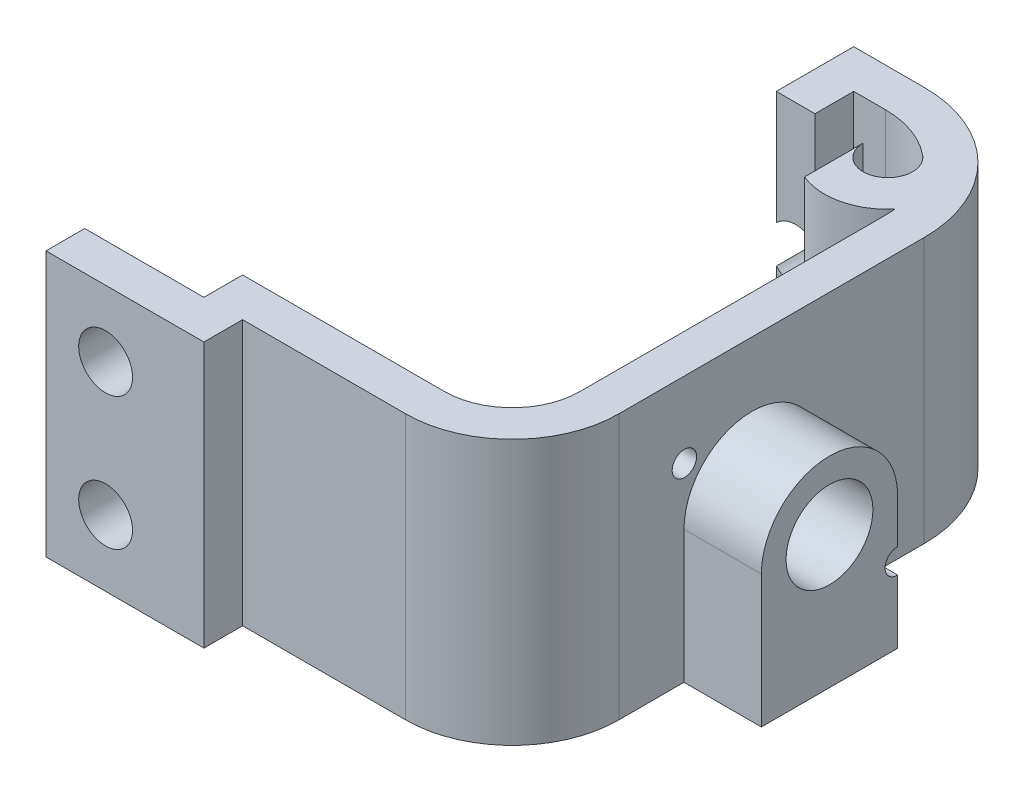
from build123d import *

# Parameters (mm, degrees)
BOSS_EXTRUDE1_DEPTH = 21.75
CUT_EXTRUDE1_REACH  = 62.665
SKETCH2_R           = 0.999998
BOSS_EXTRUDE2_START = 6.35
SKETCH4_R           = 3.5625
BOSS_EXTRUDE2_DEPTH = 6.35
CUT_EXTRUDE2_REACH  = 62.665
SKETCH4_3_R         = 3.5625
SKETCH7_R           = 2.2098
CUT_EXTRUDE3_DEPTH  = 61.338615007
SKETCH9_R           = 2.2098
CUT_EXTRUDE5_DEPTH  = 63.553979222
BOSS_EXTRUDE4_DEPTH = 21.75


with BuildPart() as part:
    # Sketch1 → Boss-Extrude1 (new body)
    with BuildSketch(Plane(origin=(0, 0, 0), x_dir=(1, 0, 0), z_dir=(0, 1, 0))):
        with BuildLine():
            Line((28.7253, 8.739808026), (28.7253, 33.787820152))
            ThreePointArc((28.7253, 33.787820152), (26.528897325, 39.090405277), (21.2263122, 41.286807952))
            Line((21.2263122, 41.286807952), (18.625420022, 41.286807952))
            Line((18.625420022, 41.286807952), (18.625420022, 38.111807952))
            Line((18.625420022, 38.111807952), (15.450420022, 38.111807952))
            Line((15.450420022, 38.111807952), (15.450420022, 44.461807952))
            Line((15.450420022, 44.461807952), (21.2263122, 44.461807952))
            ThreePointArc((21.2263122, 44.461807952), (28.773961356, 41.335469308), (31.9003, 33.787820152))
            Line((31.9003, 33.787820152), (31.9003, 8.739808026))
            ThreePointArc((31.9003, 8.739808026), (29.340469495, 2.559830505), (23.160491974, 0))
            Line((23.160491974, 0), (9.779, 0))
            Line((9.779, 0), (9.779, -3.175))
            Line((9.779, -3.175), (-3.175, -3.175))
            Line((-3.175, -3.175), (-3.175, 0))
            Line((-3.175, 0), (0, 0))
            Line((0, 0), (6.604, 0))
            Line((6.604, 0), (6.604, 3.175))
            Line((6.604, 3.175), (23.160491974, 3.175))
            ThreePointArc((23.160491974, 3.175), (27.095405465, 4.804894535), (28.7253, 8.739808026))
        make_face()
    extrude(amount=BOSS_EXTRUDE1_DEPTH)

    # Sketch2 → Cut-Extrude1 (cut, up to next)
    with BuildSketch(Plane(origin=(31.9003, 0, 0), x_dir=(0, 0, -1), z_dir=(1, 0, 0)), mode=Mode.PRIVATE) as cut_extrude1_sk1:
        with Locations((25.230136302, 6.21478983)):
            Circle(SKETCH2_R)
    cut_extrude1_tool1 = extrude(cut_extrude1_sk1.sketch, amount=-CUT_EXTRUDE1_REACH, mode=Mode.PRIVATE) & part.part
    # Sketch2 → Cut-Extrude1 (cut, up to next)
    with BuildSketch(Plane(origin=(31.9003, 0, 0), x_dir=(0, 0, -1), z_dir=(1, 0, 0)), mode=Mode.PRIVATE) as cut_extrude1_sk2:
        with Locations((14.122491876, 15.53521017)):
            Circle(SKETCH2_R)
    cut_extrude1_tool2 = extrude(cut_extrude1_sk2.sketch, amount=-CUT_EXTRUDE1_REACH, mode=Mode.PRIVATE) & part.part
    add(cut_extrude1_tool1.solids().sort_by_distance((31.9003, 6.21479, -25.230136))[0], mode=Mode.SUBTRACT)
    add(cut_extrude1_tool2.solids().sort_by_distance((31.9003, 15.53521, -14.122492))[0], mode=Mode.SUBTRACT)

    # Sketch4 → Boss-Extrude2 (add)
    with BuildSketch(Plane(origin=(31.9003, 0, 0), x_dir=(0, 0, -1), z_dir=(1, 0, 0)).offset(BOSS_EXTRUDE2_START)):
        with BuildLine():
            Line((25.264314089, 7.214203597), (25.264314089, 10.875))
            ThreePointArc((25.264314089, 10.875), (19.676314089, 16.463), (14.088314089, 10.875))
            Line((14.088314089, 10.875), (14.088314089, 0))
            Line((14.088314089, 0), (25.264314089, 0))
            Line((25.264314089, 0), (25.264314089, 5.215376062))
            ThreePointArc((25.264314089, 5.215376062), (24.230138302, 6.21478983), (25.264314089, 7.214203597))
        make_face()
        with Locations((19.676314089, 10.875)):
            Circle(SKETCH4_R, mode=Mode.SUBTRACT)
    extrude(amount=-BOSS_EXTRUDE2_DEPTH)

    # Sketch4_3 → Cut-Extrude2 (cut, up to next)
    with BuildSketch(Plane(origin=(31.9003, 0, 0), x_dir=(0, 0, -1), z_dir=(1, 0, 0)), mode=Mode.PRIVATE) as cut_extrude2_sk1:
        with Locations(Location((19.676314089, 10.875, 0), (0, 0, 180))):
            Circle(SKETCH4_3_R)
    cut_extrude2_tool1 = extrude(cut_extrude2_sk1.sketch, amount=-CUT_EXTRUDE2_REACH, mode=Mode.PRIVATE) & part.part
    add(cut_extrude2_tool1.solids().sort_by_distance((31.9003, 10.875, -19.676314))[0], mode=Mode.SUBTRACT)

    # Sketch7 → Cut-Extrude3 (cut, through all)
    with BuildSketch(Plane.XY.offset(-38.111807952)):
        with Locations((17.037920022, 10.875)):
            Circle(SKETCH7_R)
    extrude(amount=-CUT_EXTRUDE3_DEPTH, mode=Mode.SUBTRACT)

    # Sketch9 → Cut-Extrude5 (cut, through all)
    with BuildSketch(Plane(origin=(0, 0, 0), x_dir=(-1, 0, 0), z_dir=(0, 0, -1))):
        with Locations((-1.7145, 5.4375)):
            Circle(SKETCH9_R)
        with Locations((-1.7145, 16.3125)):
            Circle(SKETCH9_R)
    extrude(amount=-CUT_EXTRUDE5_DEPTH, mode=Mode.SUBTRACT)

    # Sketch11 → Boss-Extrude4 (add)
    with BuildSketch(Plane.XZ):
        with BuildLine():
            Line((22.689420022, -37.991648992), (22.689420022, -33.197504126))
            ThreePointArc((22.689420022, -33.197504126), (25.915704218, -32.923460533), (28.680182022, -34.609186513))
            ThreePointArc((28.680182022, -34.609186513), (27.830621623, -37.339990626), (26.02050086, -39.554151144))
            ThreePointArc((26.02050086, -39.554151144), (25.58434868, -36.151981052), (22.689420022, -37.991648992))
        make_face()
    extrude(amount=-BOSS_EXTRUDE4_DEPTH)


solid = part.part
